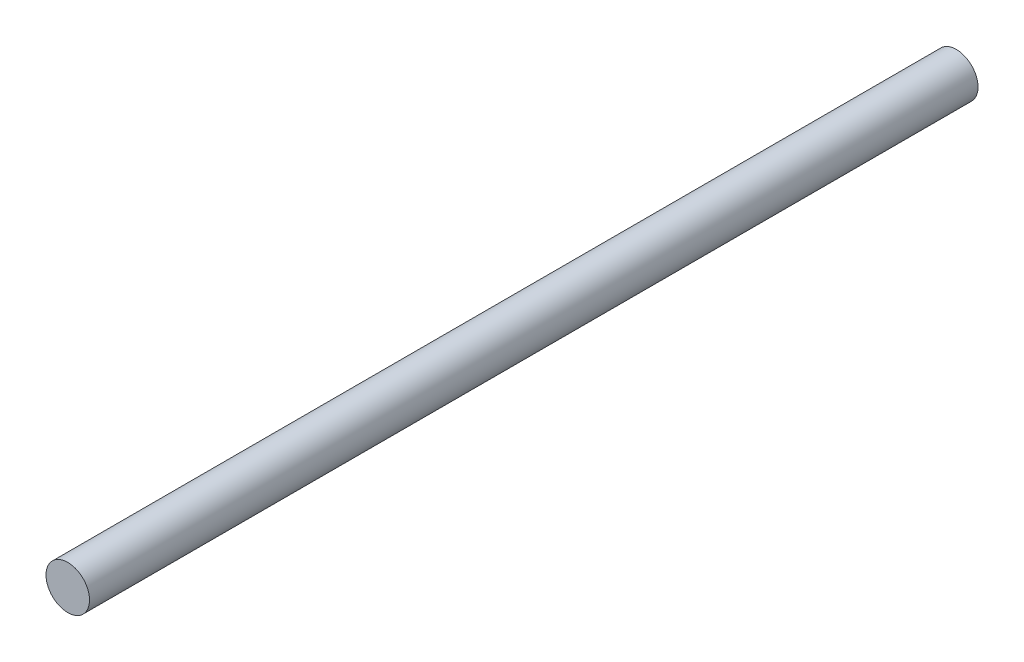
ISO-10303-21;
HEADER;
FILE_DESCRIPTION(('STEP AP214'),'2;1');
FILE_NAME('part.step','',(''),(''),'','','');
FILE_SCHEMA(('AUTOMOTIVE_DESIGN { 1 0 10303 214 1 1 1 1 }'));
ENDSEC;
DATA;
#1=APPLICATION_CONTEXT('core data for automotive mechanical design processes');
#2=APPLICATION_PROTOCOL_DEFINITION('international standard','automotive_design',2000,#1);
#3=PRODUCT_CONTEXT('',#1,'mechanical');
#4=PRODUCT('Part','Part','',(#3));
#5=PRODUCT_RELATED_PRODUCT_CATEGORY('part','',(#4));
#6=PRODUCT_DEFINITION_FORMATION('','',#4);
#7=PRODUCT_DEFINITION_CONTEXT('part definition',#1,'design');
#8=PRODUCT_DEFINITION('design','',#6,#7);
#9=PRODUCT_DEFINITION_SHAPE('','',#8);
#10=(LENGTH_UNIT() NAMED_UNIT(*) SI_UNIT(.MILLI.,.METRE.));
#11=(NAMED_UNIT(*) PLANE_ANGLE_UNIT() SI_UNIT($,.RADIAN.));
#12=(NAMED_UNIT(*) SI_UNIT($,.STERADIAN.) SOLID_ANGLE_UNIT());
#13=UNCERTAINTY_MEASURE_WITH_UNIT(LENGTH_MEASURE(1.E-05),#10,'distance_accuracy_value','');
#14=(GEOMETRIC_REPRESENTATION_CONTEXT(3) GLOBAL_UNCERTAINTY_ASSIGNED_CONTEXT((#13)) GLOBAL_UNIT_ASSIGNED_CONTEXT((#10,
#11,#12)) REPRESENTATION_CONTEXT('',''));
#15=CARTESIAN_POINT('',(0.,0.,0.));
#16=DIRECTION('',(0.,0.,1.));
#17=DIRECTION('',(1.,0.,0.));
#18=AXIS2_PLACEMENT_3D('',#15,#16,#17);
#19=CARTESIAN_POINT('',(0.,0.,490.));
#20=DIRECTION('',(0.,0.,1.));
#21=DIRECTION('',(1.,0.,0.));
#22=AXIS2_PLACEMENT_3D('',#19,#20,#21);
#23=PLANE('',#22);
#24=CARTESIAN_POINT('',(0.,0.,490.));
#25=DIRECTION('',(0.,0.,1.));
#26=DIRECTION('',(1.,0.,0.));
#27=AXIS2_PLACEMENT_3D('',#24,#25,#26);
#28=CIRCLE('',#27,12.);
#29=CARTESIAN_POINT('',(12.,0.,490.));
#30=VERTEX_POINT('',#29);
#31=EDGE_CURVE('E8',#30,#30,#28,.F.);
#32=ORIENTED_EDGE('',*,*,#31,.F.);
#33=EDGE_LOOP('',(#32));
#34=FACE_BOUND('',#33,.T.);
#35=ADVANCED_FACE('F12',(#34),#23,.T.);
#36=CARTESIAN_POINT('',(0.,0.,490.));
#37=DIRECTION('',(0.,0.,-1.));
#38=DIRECTION('',(-1.,0.,0.));
#39=AXIS2_PLACEMENT_3D('',#36,#37,#38);
#40=CYLINDRICAL_SURFACE('',#39,12.);
#41=CARTESIAN_POINT('',(0.,0.,0.));
#42=DIRECTION('',(0.,0.,-1.));
#43=DIRECTION('',(-1.,0.,0.));
#44=AXIS2_PLACEMENT_3D('',#41,#42,#43);
#45=CIRCLE('',#44,12.);
#46=CARTESIAN_POINT('',(-12.,0.,0.));
#47=VERTEX_POINT('',#46);
#48=EDGE_CURVE('E19',#47,#47,#45,.T.);
#49=ORIENTED_EDGE('',*,*,#48,.F.);
#50=EDGE_LOOP('',(#49));
#51=FACE_BOUND('',#50,.T.);
#52=ORIENTED_EDGE('',*,*,#31,.T.);
#53=EDGE_LOOP('',(#52));
#54=FACE_BOUND('',#53,.T.);
#55=ADVANCED_FACE('F14',(#51,#54),#40,.T.);
#56=CARTESIAN_POINT('',(0.,0.,0.));
#57=DIRECTION('',(0.,0.,1.));
#58=DIRECTION('',(1.,0.,0.));
#59=AXIS2_PLACEMENT_3D('',#56,#57,#58);
#60=PLANE('',#59);
#61=ORIENTED_EDGE('',*,*,#48,.T.);
#62=EDGE_LOOP('',(#61));
#63=FACE_BOUND('',#62,.T.);
#64=ADVANCED_FACE('F25',(#63),#60,.F.);
#65=CLOSED_SHELL('',(#35,#55,#64));
#66=MANIFOLD_SOLID_BREP('B1',#65);
#67=ADVANCED_BREP_SHAPE_REPRESENTATION('',(#18,#66),#14);
#68=SHAPE_DEFINITION_REPRESENTATION(#9,#67);
ENDSEC;
END-ISO-10303-21;
